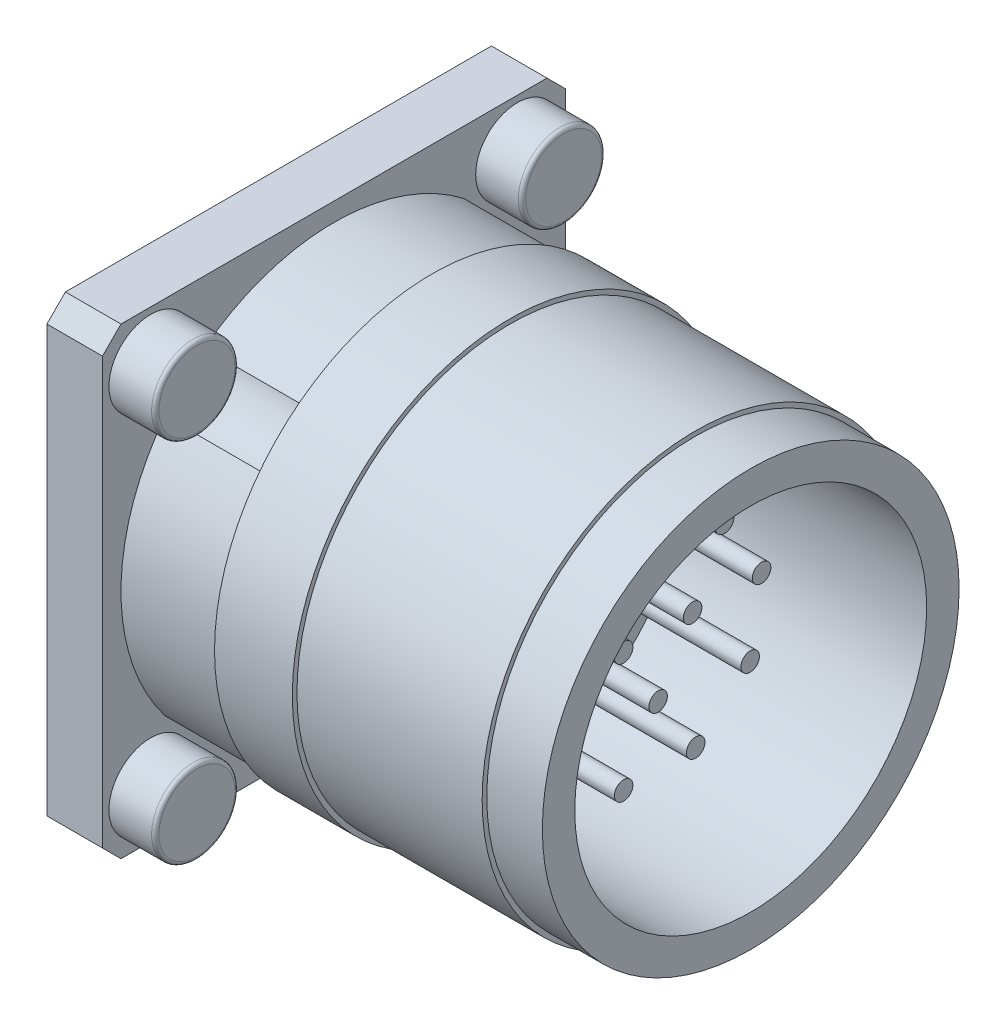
ISO-10303-21;
HEADER;
FILE_DESCRIPTION(('STEP AP214'),'2;1');
FILE_NAME('part.step','',(''),(''),'','','');
FILE_SCHEMA(('AUTOMOTIVE_DESIGN { 1 0 10303 214 1 1 1 1 }'));
ENDSEC;
DATA;
#1=APPLICATION_CONTEXT('core data for automotive mechanical design processes');
#2=APPLICATION_PROTOCOL_DEFINITION('international standard','automotive_design',2000,#1);
#3=PRODUCT_CONTEXT('',#1,'mechanical');
#4=PRODUCT('Part','Part','',(#3));
#5=PRODUCT_RELATED_PRODUCT_CATEGORY('part','',(#4));
#6=PRODUCT_DEFINITION_FORMATION('','',#4);
#7=PRODUCT_DEFINITION_CONTEXT('part definition',#1,'design');
#8=PRODUCT_DEFINITION('design','',#6,#7);
#9=PRODUCT_DEFINITION_SHAPE('','',#8);
#10=(LENGTH_UNIT() NAMED_UNIT(*) SI_UNIT(.MILLI.,.METRE.));
#11=(NAMED_UNIT(*) PLANE_ANGLE_UNIT() SI_UNIT($,.RADIAN.));
#12=(NAMED_UNIT(*) SI_UNIT($,.STERADIAN.) SOLID_ANGLE_UNIT());
#13=UNCERTAINTY_MEASURE_WITH_UNIT(LENGTH_MEASURE(1.E-05),#10,'distance_accuracy_value','');
#14=(GEOMETRIC_REPRESENTATION_CONTEXT(3) GLOBAL_UNCERTAINTY_ASSIGNED_CONTEXT((#13)) GLOBAL_UNIT_ASSIGNED_CONTEXT((#10,
#11,#12)) REPRESENTATION_CONTEXT('',''));
#15=CARTESIAN_POINT('',(0.,0.,0.));
#16=DIRECTION('',(0.,0.,1.));
#17=DIRECTION('',(1.,0.,0.));
#18=AXIS2_PLACEMENT_3D('',#15,#16,#17);
#19=CARTESIAN_POINT('',(3.,0.,24.));
#20=DIRECTION('',(1.,0.,0.));
#21=DIRECTION('',(0.,0.,-1.));
#22=AXIS2_PLACEMENT_3D('',#19,#20,#21);
#23=PLANE('',#22);
#24=CARTESIAN_POINT('',(3.,9.9,-9.9));
#25=DIRECTION('',(-1.,0.,0.));
#26=DIRECTION('',(0.,0.,1.));
#27=AXIS2_PLACEMENT_3D('',#24,#25,#26);
#28=CIRCLE('',#27,2.25);
#29=CARTESIAN_POINT('',(3.,9.9,-7.65));
#30=VERTEX_POINT('',#29);
#31=EDGE_CURVE('E351',#30,#30,#28,.T.);
#32=ORIENTED_EDGE('',*,*,#31,.T.);
#33=EDGE_LOOP('',(#32));
#34=FACE_BOUND('',#33,.T.);
#35=CARTESIAN_POINT('',(3.,9.9,9.9));
#36=DIRECTION('',(-1.,0.,0.));
#37=DIRECTION('',(0.,0.,1.));
#38=AXIS2_PLACEMENT_3D('',#35,#36,#37);
#39=CIRCLE('',#38,2.25);
#40=CARTESIAN_POINT('',(3.,9.9,12.15));
#41=VERTEX_POINT('',#40);
#42=EDGE_CURVE('E173',#41,#41,#39,.T.);
#43=ORIENTED_EDGE('',*,*,#42,.T.);
#44=EDGE_LOOP('',(#43));
#45=FACE_BOUND('',#44,.T.);
#46=DIRECTION('',(0.,0.,-1.));
#47=VECTOR('',#46,1.);
#48=CARTESIAN_POINT('',(3.,-12.5,11.5));
#49=LINE('',#48,#47);
#50=CARTESIAN_POINT('',(3.,-12.5,11.5));
#51=VERTEX_POINT('',#50);
#52=CARTESIAN_POINT('',(3.,-12.5,-11.5));
#53=VERTEX_POINT('',#52);
#54=EDGE_CURVE('E264',#51,#53,#49,.T.);
#55=ORIENTED_EDGE('',*,*,#54,.T.);
#56=DIRECTION('',(0.,0.707106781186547,-0.707106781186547));
#57=VECTOR('',#56,1.);
#58=CARTESIAN_POINT('',(3.,-12.5,-11.5));
#59=LINE('',#58,#57);
#60=CARTESIAN_POINT('',(3.,-11.5,-12.5));
#61=VERTEX_POINT('',#60);
#62=EDGE_CURVE('E266',#53,#61,#59,.T.);
#63=ORIENTED_EDGE('',*,*,#62,.T.);
#64=DIRECTION('',(0.,1.,0.));
#65=VECTOR('',#64,1.);
#66=CARTESIAN_POINT('',(3.,-11.5,-12.5));
#67=LINE('',#66,#65);
#68=CARTESIAN_POINT('',(3.,11.5,-12.5));
#69=VERTEX_POINT('',#68);
#70=EDGE_CURVE('E268',#61,#69,#67,.T.);
#71=ORIENTED_EDGE('',*,*,#70,.T.);
#72=DIRECTION('',(0.,0.707106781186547,0.707106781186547));
#73=VECTOR('',#72,1.);
#74=CARTESIAN_POINT('',(3.,11.5,-12.5));
#75=LINE('',#74,#73);
#76=CARTESIAN_POINT('',(3.,12.5,-11.5));
#77=VERTEX_POINT('',#76);
#78=EDGE_CURVE('E53',#69,#77,#75,.T.);
#79=ORIENTED_EDGE('',*,*,#78,.T.);
#80=DIRECTION('',(0.,0.,1.));
#81=VECTOR('',#80,1.);
#82=CARTESIAN_POINT('',(3.,12.5,-11.5));
#83=LINE('',#82,#81);
#84=CARTESIAN_POINT('',(3.,12.5,11.5));
#85=VERTEX_POINT('',#84);
#86=EDGE_CURVE('E48',#77,#85,#83,.T.);
#87=ORIENTED_EDGE('',*,*,#86,.T.);
#88=DIRECTION('',(0.,-0.707106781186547,0.707106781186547));
#89=VECTOR('',#88,1.);
#90=CARTESIAN_POINT('',(3.,12.5,11.5));
#91=LINE('',#90,#89);
#92=CARTESIAN_POINT('',(3.,11.5,12.5));
#93=VERTEX_POINT('',#92);
#94=EDGE_CURVE('E258',#85,#93,#91,.T.);
#95=ORIENTED_EDGE('',*,*,#94,.T.);
#96=DIRECTION('',(0.,-1.,0.));
#97=VECTOR('',#96,1.);
#98=CARTESIAN_POINT('',(3.,11.5,12.5));
#99=LINE('',#98,#97);
#100=CARTESIAN_POINT('',(3.,-11.5,12.5));
#101=VERTEX_POINT('',#100);
#102=EDGE_CURVE('E260',#93,#101,#99,.T.);
#103=ORIENTED_EDGE('',*,*,#102,.T.);
#104=DIRECTION('',(0.,-0.707106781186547,-0.707106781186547));
#105=VECTOR('',#104,1.);
#106=CARTESIAN_POINT('',(3.,-11.5,12.5));
#107=LINE('',#106,#105);
#108=EDGE_CURVE('E262',#101,#51,#107,.T.);
#109=ORIENTED_EDGE('',*,*,#108,.T.);
#110=EDGE_LOOP('',(#55,#63,#71,#79,#87,#95,#103,#109));
#111=FACE_BOUND('',#110,.T.);
#112=CARTESIAN_POINT('',(3.,9.90000000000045,9.90000000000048));
#113=DIRECTION('',(-1.,0.,0.));
#114=DIRECTION('',(0.,0.,1.));
#115=AXIS2_PLACEMENT_3D('',#112,#113,#114);
#116=CIRCLE('',#115,3.0000000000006);
#117=CARTESIAN_POINT('',(3.,9.12215188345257,7.00259559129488));
#118=VERTEX_POINT('',#117);
#119=CARTESIAN_POINT('',(3.,7.00259559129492,9.12215188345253));
#120=VERTEX_POINT('',#119);
#121=EDGE_CURVE('E151',#118,#120,#116,.T.);
#122=ORIENTED_EDGE('',*,*,#121,.F.);
#123=CARTESIAN_POINT('',(3.,0.,0.));
#124=DIRECTION('',(1.,0.,0.));
#125=DIRECTION('',(0.,0.,-1.));
#126=AXIS2_PLACEMENT_3D('',#123,#124,#125);
#127=CIRCLE('',#126,11.5);
#128=CARTESIAN_POINT('',(3.,9.1221518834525,-7.0025955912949));
#129=VERTEX_POINT('',#128);
#130=EDGE_CURVE('E193',#129,#118,#127,.T.);
#131=ORIENTED_EDGE('',*,*,#130,.F.);
#132=CARTESIAN_POINT('',(3.,9.90000000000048,-9.90000000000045));
#133=DIRECTION('',(-1.,0.,0.));
#134=DIRECTION('',(0.,0.,1.));
#135=AXIS2_PLACEMENT_3D('',#132,#133,#134);
#136=CIRCLE('',#135,3.0000000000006);
#137=CARTESIAN_POINT('',(3.,7.00259559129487,-9.12215188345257));
#138=VERTEX_POINT('',#137);
#139=EDGE_CURVE('E190',#138,#129,#136,.T.);
#140=ORIENTED_EDGE('',*,*,#139,.F.);
#141=CARTESIAN_POINT('',(3.,0.,0.));
#142=DIRECTION('',(1.,0.,0.));
#143=DIRECTION('',(0.,0.,-1.));
#144=AXIS2_PLACEMENT_3D('',#141,#142,#143);
#145=CIRCLE('',#144,11.5);
#146=CARTESIAN_POINT('',(3.,-7.0025955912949,-9.1221518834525));
#147=VERTEX_POINT('',#146);
#148=EDGE_CURVE('E187',#147,#138,#145,.T.);
#149=ORIENTED_EDGE('',*,*,#148,.F.);
#150=CARTESIAN_POINT('',(3.,-9.90000000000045,-9.90000000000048));
#151=DIRECTION('',(-1.,0.,0.));
#152=DIRECTION('',(0.,0.,1.));
#153=AXIS2_PLACEMENT_3D('',#150,#151,#152);
#154=CIRCLE('',#153,3.0000000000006);
#155=CARTESIAN_POINT('',(3.,-9.12215188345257,-7.00259559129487));
#156=VERTEX_POINT('',#155);
#157=EDGE_CURVE('E184',#156,#147,#154,.T.);
#158=ORIENTED_EDGE('',*,*,#157,.F.);
#159=CARTESIAN_POINT('',(3.,0.,0.));
#160=DIRECTION('',(1.,0.,0.));
#161=DIRECTION('',(0.,0.,-1.));
#162=AXIS2_PLACEMENT_3D('',#159,#160,#161);
#163=CIRCLE('',#162,11.5);
#164=CARTESIAN_POINT('',(3.,-9.1221518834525,7.0025955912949));
#165=VERTEX_POINT('',#164);
#166=EDGE_CURVE('E181',#165,#156,#163,.T.);
#167=ORIENTED_EDGE('',*,*,#166,.F.);
#168=CARTESIAN_POINT('',(3.,-9.90000000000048,9.90000000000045));
#169=DIRECTION('',(-1.,0.,0.));
#170=DIRECTION('',(0.,0.,1.));
#171=AXIS2_PLACEMENT_3D('',#168,#169,#170);
#172=CIRCLE('',#171,3.0000000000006);
#173=CARTESIAN_POINT('',(3.,-7.00259559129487,9.12215188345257));
#174=VERTEX_POINT('',#173);
#175=EDGE_CURVE('E155',#174,#165,#172,.T.);
#176=ORIENTED_EDGE('',*,*,#175,.F.);
#177=CARTESIAN_POINT('',(3.,0.,0.));
#178=DIRECTION('',(1.,0.,0.));
#179=DIRECTION('',(0.,0.,-1.));
#180=AXIS2_PLACEMENT_3D('',#177,#178,#179);
#181=CIRCLE('',#180,11.5);
#182=EDGE_CURVE('E146',#120,#174,#181,.T.);
#183=ORIENTED_EDGE('',*,*,#182,.F.);
#184=EDGE_LOOP('',(#122,#131,#140,#149,#158,#167,#176,#183));
#185=FACE_BOUND('',#184,.T.);
#186=CARTESIAN_POINT('',(3.,-9.9,9.9));
#187=DIRECTION('',(-1.,0.,0.));
#188=DIRECTION('',(0.,0.,1.));
#189=AXIS2_PLACEMENT_3D('',#186,#187,#188);
#190=CIRCLE('',#189,2.25);
#191=CARTESIAN_POINT('',(3.,-9.9,12.15));
#192=VERTEX_POINT('',#191);
#193=EDGE_CURVE('E360',#192,#192,#190,.T.);
#194=ORIENTED_EDGE('',*,*,#193,.T.);
#195=EDGE_LOOP('',(#194));
#196=FACE_BOUND('',#195,.T.);
#197=CARTESIAN_POINT('',(3.,-9.9,-9.9));
#198=DIRECTION('',(-1.,0.,0.));
#199=DIRECTION('',(0.,0.,1.));
#200=AXIS2_PLACEMENT_3D('',#197,#198,#199);
#201=CIRCLE('',#200,2.25);
#202=CARTESIAN_POINT('',(3.,-9.9,-7.65));
#203=VERTEX_POINT('',#202);
#204=EDGE_CURVE('E338',#203,#203,#201,.T.);
#205=ORIENTED_EDGE('',*,*,#204,.T.);
#206=EDGE_LOOP('',(#205));
#207=FACE_BOUND('',#206,.T.);
#208=ADVANCED_FACE('F31',(#34,#45,#111,#185,#196,#207),#23,.T.);
#209=CARTESIAN_POINT('',(20.5,0.,0.));
#210=DIRECTION('',(-1.,0.,0.));
#211=DIRECTION('',(0.,0.,1.));
#212=AXIS2_PLACEMENT_3D('',#209,#210,#211);
#213=CYLINDRICAL_SURFACE('',#212,11.75);
#214=CARTESIAN_POINT('',(8.3,0.,0.));
#215=DIRECTION('',(1.,0.,0.));
#216=DIRECTION('',(0.,0.,-1.));
#217=AXIS2_PLACEMENT_3D('',#214,#215,#216);
#218=CIRCLE('',#217,11.75);
#219=CARTESIAN_POINT('',(8.3,0.,-11.75));
#220=VERTEX_POINT('',#219);
#221=EDGE_CURVE('E166',#220,#220,#218,.T.);
#222=ORIENTED_EDGE('',*,*,#221,.T.);
#223=EDGE_LOOP('',(#222));
#224=FACE_BOUND('',#223,.T.);
#225=CARTESIAN_POINT('',(12.5,0.,0.));
#226=DIRECTION('',(-1.,0.,0.));
#227=DIRECTION('',(0.,0.,1.));
#228=AXIS2_PLACEMENT_3D('',#225,#226,#227);
#229=CIRCLE('',#228,11.75);
#230=CARTESIAN_POINT('',(12.5,0.,11.75));
#231=VERTEX_POINT('',#230);
#232=EDGE_CURVE('E238',#231,#231,#229,.T.);
#233=ORIENTED_EDGE('',*,*,#232,.T.);
#234=EDGE_LOOP('',(#233));
#235=FACE_BOUND('',#234,.T.);
#236=ADVANCED_FACE('F387',(#224,#235),#213,.T.);
#237=CARTESIAN_POINT('',(12.5,11.75,0.));
#238=DIRECTION('',(-1.,0.,0.));
#239=DIRECTION('',(0.,0.,1.));
#240=AXIS2_PLACEMENT_3D('',#237,#238,#239);
#241=PLANE('',#240);
#242=ORIENTED_EDGE('',*,*,#232,.F.);
#243=EDGE_LOOP('',(#242));
#244=FACE_BOUND('',#243,.T.);
#245=CARTESIAN_POINT('',(12.5,0.,0.));
#246=DIRECTION('',(-1.,0.,0.));
#247=DIRECTION('',(0.,0.,1.));
#248=AXIS2_PLACEMENT_3D('',#245,#246,#247);
#249=CIRCLE('',#248,11.5);
#250=CARTESIAN_POINT('',(12.5,0.,11.5));
#251=VERTEX_POINT('',#250);
#252=EDGE_CURVE('E235',#251,#251,#249,.T.);
#253=ORIENTED_EDGE('',*,*,#252,.T.);
#254=EDGE_LOOP('',(#253));
#255=FACE_BOUND('',#254,.T.);
#256=ADVANCED_FACE('F393',(#244,#255),#241,.F.);
#257=CARTESIAN_POINT('',(20.5,0.,0.));
#258=DIRECTION('',(-1.,0.,0.));
#259=DIRECTION('',(0.,0.,1.));
#260=AXIS2_PLACEMENT_3D('',#257,#258,#259);
#261=CYLINDRICAL_SURFACE('',#260,11.5);
#262=ORIENTED_EDGE('',*,*,#252,.F.);
#263=EDGE_LOOP('',(#262));
#264=FACE_BOUND('',#263,.T.);
#265=CARTESIAN_POINT('',(22.5,0.,0.));
#266=DIRECTION('',(-1.,0.,0.));
#267=DIRECTION('',(0.,0.,1.));
#268=AXIS2_PLACEMENT_3D('',#265,#266,#267);
#269=CIRCLE('',#268,11.5);
#270=CARTESIAN_POINT('',(22.5,0.,11.5));
#271=VERTEX_POINT('',#270);
#272=EDGE_CURVE('E232',#271,#271,#269,.T.);
#273=ORIENTED_EDGE('',*,*,#272,.T.);
#274=EDGE_LOOP('',(#273));
#275=FACE_BOUND('',#274,.T.);
#276=ADVANCED_FACE('F874',(#264,#275),#261,.T.);
#277=CARTESIAN_POINT('',(22.5,11.5,0.));
#278=DIRECTION('',(-1.,0.,0.));
#279=DIRECTION('',(0.,0.,1.));
#280=AXIS2_PLACEMENT_3D('',#277,#278,#279);
#281=PLANE('',#280);
#282=ORIENTED_EDGE('',*,*,#272,.F.);
#283=EDGE_LOOP('',(#282));
#284=FACE_BOUND('',#283,.T.);
#285=CARTESIAN_POINT('',(22.5,0.,0.));
#286=DIRECTION('',(-1.,0.,0.));
#287=DIRECTION('',(0.,0.,1.));
#288=AXIS2_PLACEMENT_3D('',#285,#286,#287);
#289=CIRCLE('',#288,11.25);
#290=CARTESIAN_POINT('',(22.5,0.,11.25));
#291=VERTEX_POINT('',#290);
#292=EDGE_CURVE('E229',#291,#291,#289,.T.);
#293=ORIENTED_EDGE('',*,*,#292,.T.);
#294=EDGE_LOOP('',(#293));
#295=FACE_BOUND('',#294,.T.);
#296=ADVANCED_FACE('F870',(#284,#295),#281,.F.);
#297=CARTESIAN_POINT('',(20.5,0.,0.));
#298=DIRECTION('',(-1.,0.,0.));
#299=DIRECTION('',(0.,0.,1.));
#300=AXIS2_PLACEMENT_3D('',#297,#298,#299);
#301=CYLINDRICAL_SURFACE('',#300,11.25);
#302=ORIENTED_EDGE('',*,*,#292,.F.);
#303=EDGE_LOOP('',(#302));
#304=FACE_BOUND('',#303,.T.);
#305=CARTESIAN_POINT('',(25.5,0.,0.));
#306=DIRECTION('',(-1.,0.,0.));
#307=DIRECTION('',(0.,0.,1.));
#308=AXIS2_PLACEMENT_3D('',#305,#306,#307);
#309=CIRCLE('',#308,11.25);
#310=CARTESIAN_POINT('',(25.5,0.,11.25));
#311=VERTEX_POINT('',#310);
#312=EDGE_CURVE('E226',#311,#311,#309,.T.);
#313=ORIENTED_EDGE('',*,*,#312,.T.);
#314=EDGE_LOOP('',(#313));
#315=FACE_BOUND('',#314,.T.);
#316=ADVANCED_FACE('F866',(#304,#315),#301,.T.);
#317=CARTESIAN_POINT('',(25.5,11.25,0.));
#318=DIRECTION('',(-1.,0.,0.));
#319=DIRECTION('',(0.,0.,1.));
#320=AXIS2_PLACEMENT_3D('',#317,#318,#319);
#321=PLANE('',#320);
#322=ORIENTED_EDGE('',*,*,#312,.F.);
#323=EDGE_LOOP('',(#322));
#324=FACE_BOUND('',#323,.T.);
#325=CARTESIAN_POINT('',(25.5,0.,0.));
#326=DIRECTION('',(-1.,0.,0.));
#327=DIRECTION('',(0.,0.,1.));
#328=AXIS2_PLACEMENT_3D('',#325,#326,#327);
#329=CIRCLE('',#328,9.5);
#330=CARTESIAN_POINT('',(25.5,0.,9.5));
#331=VERTEX_POINT('',#330);
#332=EDGE_CURVE('E223',#331,#331,#329,.T.);
#333=ORIENTED_EDGE('',*,*,#332,.T.);
#334=EDGE_LOOP('',(#333));
#335=FACE_BOUND('',#334,.T.);
#336=ADVANCED_FACE('F617',(#324,#335),#321,.F.);
#337=CARTESIAN_POINT('',(20.5,0.,0.));
#338=DIRECTION('',(-1.,0.,0.));
#339=DIRECTION('',(0.,0.,1.));
#340=AXIS2_PLACEMENT_3D('',#337,#338,#339);
#341=CYLINDRICAL_SURFACE('',#340,9.5);
#342=ORIENTED_EDGE('',*,*,#332,.F.);
#343=EDGE_LOOP('',(#342));
#344=FACE_BOUND('',#343,.T.);
#345=CARTESIAN_POINT('',(12.5,0.,0.));
#346=DIRECTION('',(1.,0.,0.));
#347=DIRECTION('',(0.,0.,-1.));
#348=AXIS2_PLACEMENT_3D('',#345,#346,#347);
#349=CIRCLE('',#348,9.5);
#350=CARTESIAN_POINT('',(12.5,0.,-9.5));
#351=VERTEX_POINT('',#350);
#352=EDGE_CURVE('E298',#351,#351,#349,.T.);
#353=ORIENTED_EDGE('',*,*,#352,.F.);
#354=EDGE_LOOP('',(#353));
#355=FACE_BOUND('',#354,.T.);
#356=ADVANCED_FACE('F611',(#344,#355),#341,.F.);
#357=CARTESIAN_POINT('',(8.3,0.,0.));
#358=DIRECTION('',(1.,0.,0.));
#359=DIRECTION('',(0.,0.,-1.));
#360=AXIS2_PLACEMENT_3D('',#357,#358,#359);
#361=PLANE('',#360);
#362=CARTESIAN_POINT('',(8.3,0.,0.));
#363=DIRECTION('',(1.,0.,0.));
#364=DIRECTION('',(0.,0.,-1.));
#365=AXIS2_PLACEMENT_3D('',#362,#363,#364);
#366=CIRCLE('',#365,11.5);
#367=CARTESIAN_POINT('',(8.3,7.00259559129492,9.12215188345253));
#368=VERTEX_POINT('',#367);
#369=CARTESIAN_POINT('',(8.3,-7.00259559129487,9.12215188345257));
#370=VERTEX_POINT('',#369);
#371=EDGE_CURVE('E163',#368,#370,#366,.T.);
#372=ORIENTED_EDGE('',*,*,#371,.T.);
#373=CARTESIAN_POINT('',(8.3,-9.90000000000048,9.90000000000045));
#374=DIRECTION('',(-1.,0.,0.));
#375=DIRECTION('',(0.,0.,1.));
#376=AXIS2_PLACEMENT_3D('',#373,#374,#375);
#377=CIRCLE('',#376,3.0000000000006);
#378=CARTESIAN_POINT('',(8.3,-9.1221518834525,7.0025955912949));
#379=VERTEX_POINT('',#378);
#380=EDGE_CURVE('E198',#370,#379,#377,.T.);
#381=ORIENTED_EDGE('',*,*,#380,.T.);
#382=CARTESIAN_POINT('',(8.3,0.,0.));
#383=DIRECTION('',(1.,0.,0.));
#384=DIRECTION('',(0.,0.,-1.));
#385=AXIS2_PLACEMENT_3D('',#382,#383,#384);
#386=CIRCLE('',#385,11.5);
#387=CARTESIAN_POINT('',(8.3,-9.12215188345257,-7.00259559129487));
#388=VERTEX_POINT('',#387);
#389=EDGE_CURVE('E200',#379,#388,#386,.T.);
#390=ORIENTED_EDGE('',*,*,#389,.T.);
#391=CARTESIAN_POINT('',(8.3,-9.90000000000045,-9.90000000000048));
#392=DIRECTION('',(-1.,0.,0.));
#393=DIRECTION('',(0.,0.,1.));
#394=AXIS2_PLACEMENT_3D('',#391,#392,#393);
#395=CIRCLE('',#394,3.0000000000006);
#396=CARTESIAN_POINT('',(8.3,-7.0025955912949,-9.1221518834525));
#397=VERTEX_POINT('',#396);
#398=EDGE_CURVE('E202',#388,#397,#395,.T.);
#399=ORIENTED_EDGE('',*,*,#398,.T.);
#400=CARTESIAN_POINT('',(8.3,0.,0.));
#401=DIRECTION('',(1.,0.,0.));
#402=DIRECTION('',(0.,0.,-1.));
#403=AXIS2_PLACEMENT_3D('',#400,#401,#402);
#404=CIRCLE('',#403,11.5);
#405=CARTESIAN_POINT('',(8.3,7.00259559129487,-9.12215188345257));
#406=VERTEX_POINT('',#405);
#407=EDGE_CURVE('E204',#397,#406,#404,.T.);
#408=ORIENTED_EDGE('',*,*,#407,.T.);
#409=CARTESIAN_POINT('',(8.3,9.90000000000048,-9.90000000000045));
#410=DIRECTION('',(-1.,0.,0.));
#411=DIRECTION('',(0.,0.,1.));
#412=AXIS2_PLACEMENT_3D('',#409,#410,#411);
#413=CIRCLE('',#412,3.0000000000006);
#414=CARTESIAN_POINT('',(8.3,9.12215188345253,-7.00259559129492));
#415=VERTEX_POINT('',#414);
#416=EDGE_CURVE('E206',#406,#415,#413,.T.);
#417=ORIENTED_EDGE('',*,*,#416,.T.);
#418=CARTESIAN_POINT('',(8.3,0.,0.));
#419=DIRECTION('',(1.,0.,0.));
#420=DIRECTION('',(0.,0.,-1.));
#421=AXIS2_PLACEMENT_3D('',#418,#419,#420);
#422=CIRCLE('',#421,11.5);
#423=CARTESIAN_POINT('',(8.3,9.12215188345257,7.00259559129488));
#424=VERTEX_POINT('',#423);
#425=EDGE_CURVE('E209',#415,#424,#422,.T.);
#426=ORIENTED_EDGE('',*,*,#425,.T.);
#427=CARTESIAN_POINT('',(8.3,9.90000000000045,9.90000000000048));
#428=DIRECTION('',(-1.,0.,0.));
#429=DIRECTION('',(0.,0.,1.));
#430=AXIS2_PLACEMENT_3D('',#427,#428,#429);
#431=CIRCLE('',#430,3.0000000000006);
#432=EDGE_CURVE('E195',#424,#368,#431,.T.);
#433=ORIENTED_EDGE('',*,*,#432,.T.);
#434=EDGE_LOOP('',(#372,#381,#390,#399,#408,#417,#426,#433));
#435=FACE_BOUND('',#434,.T.);
#436=ORIENTED_EDGE('',*,*,#221,.F.);
#437=EDGE_LOOP('',(#436));
#438=FACE_BOUND('',#437,.T.);
#439=ADVANCED_FACE('F616',(#435,#438),#361,.F.);
#440=CARTESIAN_POINT('',(8.3,9.90000000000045,9.90000000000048));
#441=DIRECTION('',(-1.,0.,0.));
#442=DIRECTION('',(0.,0.,1.));
#443=AXIS2_PLACEMENT_3D('',#440,#441,#442);
#444=CYLINDRICAL_SURFACE('',#443,3.0000000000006);
#445=ORIENTED_EDGE('',*,*,#121,.T.);
#446=DIRECTION('',(-1.,0.,0.));
#447=VECTOR('',#446,1.);
#448=CARTESIAN_POINT('',(8.3,7.00259559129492,9.12215188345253));
#449=LINE('',#448,#447);
#450=EDGE_CURVE('E161',#368,#120,#449,.T.);
#451=ORIENTED_EDGE('',*,*,#450,.F.);
#452=ORIENTED_EDGE('',*,*,#432,.F.);
#453=DIRECTION('',(-1.,0.,0.));
#454=VECTOR('',#453,1.);
#455=CARTESIAN_POINT('',(8.3,9.12215188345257,7.00259559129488));
#456=LINE('',#455,#454);
#457=EDGE_CURVE('E171',#424,#118,#456,.T.);
#458=ORIENTED_EDGE('',*,*,#457,.T.);
#459=EDGE_LOOP('',(#445,#451,#452,#458));
#460=FACE_BOUND('',#459,.T.);
#461=ADVANCED_FACE('F169',(#460),#444,.F.);
#462=CARTESIAN_POINT('',(8.3,0.,0.));
#463=DIRECTION('',(-1.,0.,0.));
#464=DIRECTION('',(0.,0.,1.));
#465=AXIS2_PLACEMENT_3D('',#462,#463,#464);
#466=CYLINDRICAL_SURFACE('',#465,11.5);
#467=ORIENTED_EDGE('',*,*,#182,.T.);
#468=DIRECTION('',(-1.,0.,0.));
#469=VECTOR('',#468,1.);
#470=CARTESIAN_POINT('',(8.3,-7.00259559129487,9.12215188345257));
#471=LINE('',#470,#469);
#472=EDGE_CURVE('E167',#370,#174,#471,.T.);
#473=ORIENTED_EDGE('',*,*,#472,.F.);
#474=ORIENTED_EDGE('',*,*,#371,.F.);
#475=ORIENTED_EDGE('',*,*,#450,.T.);
#476=EDGE_LOOP('',(#467,#473,#474,#475));
#477=FACE_BOUND('',#476,.T.);
#478=ADVANCED_FACE('F162',(#477),#466,.T.);
#479=CARTESIAN_POINT('',(8.3,-9.90000000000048,9.90000000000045));
#480=DIRECTION('',(-1.,0.,0.));
#481=DIRECTION('',(0.,0.,1.));
#482=AXIS2_PLACEMENT_3D('',#479,#480,#481);
#483=CYLINDRICAL_SURFACE('',#482,3.0000000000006);
#484=ORIENTED_EDGE('',*,*,#175,.T.);
#485=DIRECTION('',(-1.,0.,0.));
#486=VECTOR('',#485,1.);
#487=CARTESIAN_POINT('',(8.3,-9.1221518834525,7.0025955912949));
#488=LINE('',#487,#486);
#489=EDGE_CURVE('E220',#379,#165,#488,.T.);
#490=ORIENTED_EDGE('',*,*,#489,.F.);
#491=ORIENTED_EDGE('',*,*,#380,.F.);
#492=ORIENTED_EDGE('',*,*,#472,.T.);
#493=EDGE_LOOP('',(#484,#490,#491,#492));
#494=FACE_BOUND('',#493,.T.);
#495=ADVANCED_FACE('F1020',(#494),#483,.F.);
#496=CARTESIAN_POINT('',(8.3,0.,0.));
#497=DIRECTION('',(-1.,0.,0.));
#498=DIRECTION('',(0.,0.,1.));
#499=AXIS2_PLACEMENT_3D('',#496,#497,#498);
#500=CYLINDRICAL_SURFACE('',#499,11.5);
#501=ORIENTED_EDGE('',*,*,#166,.T.);
#502=DIRECTION('',(-1.,0.,0.));
#503=VECTOR('',#502,1.);
#504=CARTESIAN_POINT('',(8.3,-9.12215188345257,-7.00259559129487));
#505=LINE('',#504,#503);
#506=EDGE_CURVE('E218',#388,#156,#505,.T.);
#507=ORIENTED_EDGE('',*,*,#506,.F.);
#508=ORIENTED_EDGE('',*,*,#389,.F.);
#509=ORIENTED_EDGE('',*,*,#489,.T.);
#510=EDGE_LOOP('',(#501,#507,#508,#509));
#511=FACE_BOUND('',#510,.T.);
#512=ADVANCED_FACE('F1029',(#511),#500,.T.);
#513=CARTESIAN_POINT('',(8.3,-9.90000000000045,-9.90000000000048));
#514=DIRECTION('',(-1.,0.,0.));
#515=DIRECTION('',(0.,0.,1.));
#516=AXIS2_PLACEMENT_3D('',#513,#514,#515);
#517=CYLINDRICAL_SURFACE('',#516,3.0000000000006);
#518=ORIENTED_EDGE('',*,*,#157,.T.);
#519=DIRECTION('',(-1.,0.,0.));
#520=VECTOR('',#519,1.);
#521=CARTESIAN_POINT('',(8.3,-7.0025955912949,-9.1221518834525));
#522=LINE('',#521,#520);
#523=EDGE_CURVE('E216',#397,#147,#522,.T.);
#524=ORIENTED_EDGE('',*,*,#523,.F.);
#525=ORIENTED_EDGE('',*,*,#398,.F.);
#526=ORIENTED_EDGE('',*,*,#506,.T.);
#527=EDGE_LOOP('',(#518,#524,#525,#526));
#528=FACE_BOUND('',#527,.T.);
#529=ADVANCED_FACE('F1039',(#528),#517,.F.);
#530=CARTESIAN_POINT('',(8.3,0.,0.));
#531=DIRECTION('',(-1.,0.,0.));
#532=DIRECTION('',(0.,0.,1.));
#533=AXIS2_PLACEMENT_3D('',#530,#531,#532);
#534=CYLINDRICAL_SURFACE('',#533,11.5);
#535=ORIENTED_EDGE('',*,*,#148,.T.);
#536=DIRECTION('',(-1.,0.,0.));
#537=VECTOR('',#536,1.);
#538=CARTESIAN_POINT('',(8.3,7.00259559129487,-9.12215188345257));
#539=LINE('',#538,#537);
#540=EDGE_CURVE('E214',#406,#138,#539,.T.);
#541=ORIENTED_EDGE('',*,*,#540,.F.);
#542=ORIENTED_EDGE('',*,*,#407,.F.);
#543=ORIENTED_EDGE('',*,*,#523,.T.);
#544=EDGE_LOOP('',(#535,#541,#542,#543));
#545=FACE_BOUND('',#544,.T.);
#546=ADVANCED_FACE('F1049',(#545),#534,.T.);
#547=CARTESIAN_POINT('',(8.3,9.90000000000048,-9.90000000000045));
#548=DIRECTION('',(-1.,0.,0.));
#549=DIRECTION('',(0.,0.,1.));
#550=AXIS2_PLACEMENT_3D('',#547,#548,#549);
#551=CYLINDRICAL_SURFACE('',#550,3.0000000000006);
#552=ORIENTED_EDGE('',*,*,#139,.T.);
#553=DIRECTION('',(-1.,0.,0.));
#554=VECTOR('',#553,1.);
#555=CARTESIAN_POINT('',(8.3,9.1221518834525,-7.0025955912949));
#556=LINE('',#555,#554);
#557=EDGE_CURVE('E212',#415,#129,#556,.T.);
#558=ORIENTED_EDGE('',*,*,#557,.F.);
#559=ORIENTED_EDGE('',*,*,#416,.F.);
#560=ORIENTED_EDGE('',*,*,#540,.T.);
#561=EDGE_LOOP('',(#552,#558,#559,#560));
#562=FACE_BOUND('',#561,.T.);
#563=ADVANCED_FACE('F1058',(#562),#551,.F.);
#564=CARTESIAN_POINT('',(8.3,0.,0.));
#565=DIRECTION('',(-1.,0.,0.));
#566=DIRECTION('',(0.,0.,1.));
#567=AXIS2_PLACEMENT_3D('',#564,#565,#566);
#568=CYLINDRICAL_SURFACE('',#567,11.5);
#569=ORIENTED_EDGE('',*,*,#130,.T.);
#570=ORIENTED_EDGE('',*,*,#457,.F.);
#571=ORIENTED_EDGE('',*,*,#425,.F.);
#572=ORIENTED_EDGE('',*,*,#557,.T.);
#573=EDGE_LOOP('',(#569,#570,#571,#572));
#574=FACE_BOUND('',#573,.T.);
#575=ADVANCED_FACE('F423',(#574),#568,.T.);
#576=CARTESIAN_POINT('',(3.,-11.5,12.5));
#577=DIRECTION('',(0.,0.707106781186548,-0.707106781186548));
#578=DIRECTION('',(0.,0.707106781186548,0.707106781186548));
#579=AXIS2_PLACEMENT_3D('',#576,#577,#578);
#580=PLANE('',#579);
#581=DIRECTION('',(0.,-0.707106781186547,-0.707106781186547));
#582=VECTOR('',#581,1.);
#583=CARTESIAN_POINT('',(0.,-11.5,12.5));
#584=LINE('',#583,#582);
#585=CARTESIAN_POINT('',(0.,-11.5,12.5));
#586=VERTEX_POINT('',#585);
#587=CARTESIAN_POINT('',(0.,-12.5,11.5));
#588=VERTEX_POINT('',#587);
#589=EDGE_CURVE('E246',#586,#588,#584,.T.);
#590=ORIENTED_EDGE('',*,*,#589,.T.);
#591=DIRECTION('',(-1.,0.,0.));
#592=VECTOR('',#591,1.);
#593=CARTESIAN_POINT('',(3.,-12.5,11.5));
#594=LINE('',#593,#592);
#595=EDGE_CURVE('E287',#51,#588,#594,.T.);
#596=ORIENTED_EDGE('',*,*,#595,.F.);
#597=ORIENTED_EDGE('',*,*,#108,.F.);
#598=DIRECTION('',(-1.,0.,0.));
#599=VECTOR('',#598,1.);
#600=CARTESIAN_POINT('',(3.,-11.5,12.5));
#601=LINE('',#600,#599);
#602=EDGE_CURVE('E40',#101,#586,#601,.T.);
#603=ORIENTED_EDGE('',*,*,#602,.T.);
#604=EDGE_LOOP('',(#590,#596,#597,#603));
#605=FACE_BOUND('',#604,.T.);
#606=ADVANCED_FACE('F421',(#605),#580,.F.);
#607=CARTESIAN_POINT('',(3.,12.5,11.5));
#608=DIRECTION('',(0.,-0.707106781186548,-0.707106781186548));
#609=DIRECTION('',(0.,0.707106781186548,-0.707106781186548));
#610=AXIS2_PLACEMENT_3D('',#607,#608,#609);
#611=PLANE('',#610);
#612=DIRECTION('',(0.,-0.707106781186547,0.707106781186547));
#613=VECTOR('',#612,1.);
#614=CARTESIAN_POINT('',(0.,12.5,11.5));
#615=LINE('',#614,#613);
#616=CARTESIAN_POINT('',(0.,12.5,11.5));
#617=VERTEX_POINT('',#616);
#618=CARTESIAN_POINT('',(0.,11.5,12.5));
#619=VERTEX_POINT('',#618);
#620=EDGE_CURVE('E241',#617,#619,#615,.T.);
#621=ORIENTED_EDGE('',*,*,#620,.T.);
#622=DIRECTION('',(-1.,0.,0.));
#623=VECTOR('',#622,1.);
#624=CARTESIAN_POINT('',(3.,11.5,12.5));
#625=LINE('',#624,#623);
#626=EDGE_CURVE('E11',#93,#619,#625,.T.);
#627=ORIENTED_EDGE('',*,*,#626,.F.);
#628=ORIENTED_EDGE('',*,*,#94,.F.);
#629=DIRECTION('',(-1.,0.,0.));
#630=VECTOR('',#629,1.);
#631=CARTESIAN_POINT('',(3.,12.5,11.5));
#632=LINE('',#631,#630);
#633=EDGE_CURVE('E272',#85,#617,#632,.T.);
#634=ORIENTED_EDGE('',*,*,#633,.T.);
#635=EDGE_LOOP('',(#621,#627,#628,#634));
#636=FACE_BOUND('',#635,.T.);
#637=ADVANCED_FACE('F33',(#636),#611,.F.);
#638=CARTESIAN_POINT('',(3.,11.5,-12.5));
#639=DIRECTION('',(0.,-0.707106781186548,0.707106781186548));
#640=DIRECTION('',(0.,-0.707106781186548,-0.707106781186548));
#641=AXIS2_PLACEMENT_3D('',#638,#639,#640);
#642=PLANE('',#641);
#643=DIRECTION('',(0.,0.707106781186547,0.707106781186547));
#644=VECTOR('',#643,1.);
#645=CARTESIAN_POINT('',(0.,11.5,-12.5));
#646=LINE('',#645,#644);
#647=CARTESIAN_POINT('',(0.,11.5,-12.5));
#648=VERTEX_POINT('',#647);
#649=CARTESIAN_POINT('',(0.,12.5,-11.5));
#650=VERTEX_POINT('',#649);
#651=EDGE_CURVE('E254',#648,#650,#646,.T.);
#652=ORIENTED_EDGE('',*,*,#651,.T.);
#653=DIRECTION('',(-1.,0.,0.));
#654=VECTOR('',#653,1.);
#655=CARTESIAN_POINT('',(3.,12.5,-11.5));
#656=LINE('',#655,#654);
#657=EDGE_CURVE('E275',#77,#650,#656,.T.);
#658=ORIENTED_EDGE('',*,*,#657,.F.);
#659=ORIENTED_EDGE('',*,*,#78,.F.);
#660=DIRECTION('',(-1.,0.,0.));
#661=VECTOR('',#660,1.);
#662=CARTESIAN_POINT('',(3.,11.5,-12.5));
#663=LINE('',#662,#661);
#664=EDGE_CURVE('E278',#69,#648,#663,.T.);
#665=ORIENTED_EDGE('',*,*,#664,.T.);
#666=EDGE_LOOP('',(#652,#658,#659,#665));
#667=FACE_BOUND('',#666,.T.);
#668=ADVANCED_FACE('F406',(#667),#642,.F.);
#669=CARTESIAN_POINT('',(0.,0.,24.));
#670=DIRECTION('',(1.,0.,0.));
#671=DIRECTION('',(0.,0.,-1.));
#672=AXIS2_PLACEMENT_3D('',#669,#670,#671);
#673=PLANE('',#672);
#674=ORIENTED_EDGE('',*,*,#620,.F.);
#675=DIRECTION('',(0.,0.,1.));
#676=VECTOR('',#675,1.);
#677=CARTESIAN_POINT('',(0.,12.5,-11.5));
#678=LINE('',#677,#676);
#679=EDGE_CURVE('E256',#650,#617,#678,.T.);
#680=ORIENTED_EDGE('',*,*,#679,.F.);
#681=ORIENTED_EDGE('',*,*,#651,.F.);
#682=DIRECTION('',(0.,1.,0.));
#683=VECTOR('',#682,1.);
#684=CARTESIAN_POINT('',(0.,-11.5,-12.5));
#685=LINE('',#684,#683);
#686=CARTESIAN_POINT('',(0.,-11.5,-12.5));
#687=VERTEX_POINT('',#686);
#688=EDGE_CURVE('E252',#687,#648,#685,.T.);
#689=ORIENTED_EDGE('',*,*,#688,.F.);
#690=DIRECTION('',(0.,0.707106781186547,-0.707106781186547));
#691=VECTOR('',#690,1.);
#692=CARTESIAN_POINT('',(0.,-12.5,-11.5));
#693=LINE('',#692,#691);
#694=CARTESIAN_POINT('',(0.,-12.5,-11.5));
#695=VERTEX_POINT('',#694);
#696=EDGE_CURVE('E250',#695,#687,#693,.T.);
#697=ORIENTED_EDGE('',*,*,#696,.F.);
#698=DIRECTION('',(0.,0.,-1.));
#699=VECTOR('',#698,1.);
#700=CARTESIAN_POINT('',(0.,-12.5,11.5));
#701=LINE('',#700,#699);
#702=EDGE_CURVE('E248',#588,#695,#701,.T.);
#703=ORIENTED_EDGE('',*,*,#702,.F.);
#704=ORIENTED_EDGE('',*,*,#589,.F.);
#705=DIRECTION('',(0.,-1.,0.));
#706=VECTOR('',#705,1.);
#707=CARTESIAN_POINT('',(0.,11.5,12.5));
#708=LINE('',#707,#706);
#709=EDGE_CURVE('E244',#619,#586,#708,.T.);
#710=ORIENTED_EDGE('',*,*,#709,.F.);
#711=EDGE_LOOP('',(#674,#680,#681,#689,#697,#703,#704,#710));
#712=FACE_BOUND('',#711,.T.);
#713=ADVANCED_FACE('F399',(#712),#673,.F.);
#714=CARTESIAN_POINT('',(3.,-12.5,-11.5));
#715=DIRECTION('',(0.,0.707106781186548,0.707106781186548));
#716=DIRECTION('',(0.,-0.707106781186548,0.707106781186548));
#717=AXIS2_PLACEMENT_3D('',#714,#715,#716);
#718=PLANE('',#717);
#719=ORIENTED_EDGE('',*,*,#696,.T.);
#720=DIRECTION('',(-1.,0.,0.));
#721=VECTOR('',#720,1.);
#722=CARTESIAN_POINT('',(3.,-11.5,-12.5));
#723=LINE('',#722,#721);
#724=EDGE_CURVE('E281',#61,#687,#723,.T.);
#725=ORIENTED_EDGE('',*,*,#724,.F.);
#726=ORIENTED_EDGE('',*,*,#62,.F.);
#727=DIRECTION('',(-1.,0.,0.));
#728=VECTOR('',#727,1.);
#729=CARTESIAN_POINT('',(3.,-12.5,-11.5));
#730=LINE('',#729,#728);
#731=EDGE_CURVE('E284',#53,#695,#730,.T.);
#732=ORIENTED_EDGE('',*,*,#731,.T.);
#733=EDGE_LOOP('',(#719,#725,#726,#732));
#734=FACE_BOUND('',#733,.T.);
#735=ADVANCED_FACE('F413',(#734),#718,.F.);
#736=CARTESIAN_POINT('',(3.,-12.5,11.5));
#737=DIRECTION('',(0.,1.,0.));
#738=DIRECTION('',(0.,0.,1.));
#739=AXIS2_PLACEMENT_3D('',#736,#737,#738);
#740=PLANE('',#739);
#741=ORIENTED_EDGE('',*,*,#702,.T.);
#742=ORIENTED_EDGE('',*,*,#731,.F.);
#743=ORIENTED_EDGE('',*,*,#54,.F.);
#744=ORIENTED_EDGE('',*,*,#595,.T.);
#745=EDGE_LOOP('',(#741,#742,#743,#744));
#746=FACE_BOUND('',#745,.T.);
#747=ADVANCED_FACE('F416',(#746),#740,.F.);
#748=CARTESIAN_POINT('',(3.,11.5,12.5));
#749=DIRECTION('',(0.,0.,-1.));
#750=DIRECTION('',(-1.,0.,0.));
#751=AXIS2_PLACEMENT_3D('',#748,#749,#750);
#752=PLANE('',#751);
#753=ORIENTED_EDGE('',*,*,#709,.T.);
#754=ORIENTED_EDGE('',*,*,#602,.F.);
#755=ORIENTED_EDGE('',*,*,#102,.F.);
#756=ORIENTED_EDGE('',*,*,#626,.T.);
#757=EDGE_LOOP('',(#753,#754,#755,#756));
#758=FACE_BOUND('',#757,.T.);
#759=ADVANCED_FACE('F404',(#758),#752,.F.);
#760=CARTESIAN_POINT('',(3.,12.5,-11.5));
#761=DIRECTION('',(0.,-1.,0.));
#762=DIRECTION('',(0.,0.,-1.));
#763=AXIS2_PLACEMENT_3D('',#760,#761,#762);
#764=PLANE('',#763);
#765=ORIENTED_EDGE('',*,*,#679,.T.);
#766=ORIENTED_EDGE('',*,*,#633,.F.);
#767=ORIENTED_EDGE('',*,*,#86,.F.);
#768=ORIENTED_EDGE('',*,*,#657,.T.);
#769=EDGE_LOOP('',(#765,#766,#767,#768));
#770=FACE_BOUND('',#769,.T.);
#771=ADVANCED_FACE('F400',(#770),#764,.F.);
#772=CARTESIAN_POINT('',(3.,-11.5,-12.5));
#773=DIRECTION('',(0.,0.,1.));
#774=DIRECTION('',(1.,0.,0.));
#775=AXIS2_PLACEMENT_3D('',#772,#773,#774);
#776=PLANE('',#775);
#777=ORIENTED_EDGE('',*,*,#688,.T.);
#778=ORIENTED_EDGE('',*,*,#664,.F.);
#779=ORIENTED_EDGE('',*,*,#70,.F.);
#780=ORIENTED_EDGE('',*,*,#724,.T.);
#781=EDGE_LOOP('',(#777,#778,#779,#780));
#782=FACE_BOUND('',#781,.T.);
#783=ADVANCED_FACE('F403',(#782),#776,.F.);
#784=CARTESIAN_POINT('',(5.5,9.9,9.9));
#785=DIRECTION('',(-1.,0.,0.));
#786=DIRECTION('',(0.,0.,1.));
#787=AXIS2_PLACEMENT_3D('',#784,#785,#786);
#788=CYLINDRICAL_SURFACE('',#787,2.25);
#789=ORIENTED_EDGE('',*,*,#42,.F.);
#790=EDGE_LOOP('',(#789));
#791=FACE_BOUND('',#790,.T.);
#792=CARTESIAN_POINT('',(5.3,9.9,9.9));
#793=DIRECTION('',(-1.,0.,0.));
#794=DIRECTION('',(0.,0.,1.));
#795=AXIS2_PLACEMENT_3D('',#792,#793,#794);
#796=CIRCLE('',#795,2.25);
#797=CARTESIAN_POINT('',(5.3,9.9,12.15));
#798=VERTEX_POINT('',#797);
#799=EDGE_CURVE('E176',#798,#798,#796,.T.);
#800=ORIENTED_EDGE('',*,*,#799,.T.);
#801=EDGE_LOOP('',(#800));
#802=FACE_BOUND('',#801,.T.);
#803=ADVANCED_FACE('F368',(#791,#802),#788,.T.);
#804=CARTESIAN_POINT('',(5.29999999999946,9.9,9.9));
#805=DIRECTION('',(-1.,0.,0.));
#806=DIRECTION('',(0.,0.,1.));
#807=AXIS2_PLACEMENT_3D('',#804,#805,#806);
#808=TOROIDAL_SURFACE('',#807,2.04999999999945,0.200000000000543);
#809=ORIENTED_EDGE('',*,*,#799,.F.);
#810=EDGE_LOOP('',(#809));
#811=FACE_BOUND('',#810,.T.);
#812=CARTESIAN_POINT('',(5.5,9.9,9.9));
#813=DIRECTION('',(-1.,0.,0.));
#814=DIRECTION('',(0.,0.,1.));
#815=AXIS2_PLACEMENT_3D('',#812,#813,#814);
#816=CIRCLE('',#815,2.05);
#817=CARTESIAN_POINT('',(5.5,9.9,11.95));
#818=VERTEX_POINT('',#817);
#819=EDGE_CURVE('E363',#818,#818,#816,.T.);
#820=ORIENTED_EDGE('',*,*,#819,.T.);
#821=EDGE_LOOP('',(#820));
#822=FACE_BOUND('',#821,.T.);
#823=ADVANCED_FACE('F370',(#811,#822),#808,.T.);
#824=CARTESIAN_POINT('',(5.5,11.95,9.9));
#825=DIRECTION('',(-1.,0.,0.));
#826=DIRECTION('',(0.,0.,1.));
#827=AXIS2_PLACEMENT_3D('',#824,#825,#826);
#828=PLANE('',#827);
#829=ORIENTED_EDGE('',*,*,#819,.F.);
#830=EDGE_LOOP('',(#829));
#831=FACE_BOUND('',#830,.T.);
#832=ADVANCED_FACE('F373',(#831),#828,.F.);
#833=CARTESIAN_POINT('',(5.5,-9.9,9.9));
#834=DIRECTION('',(-1.,0.,0.));
#835=DIRECTION('',(0.,0.,1.));
#836=AXIS2_PLACEMENT_3D('',#833,#834,#835);
#837=CYLINDRICAL_SURFACE('',#836,2.25);
#838=ORIENTED_EDGE('',*,*,#193,.F.);
#839=EDGE_LOOP('',(#838));
#840=FACE_BOUND('',#839,.T.);
#841=CARTESIAN_POINT('',(5.3,-9.9,9.9));
#842=DIRECTION('',(-1.,0.,0.));
#843=DIRECTION('',(0.,0.,1.));
#844=AXIS2_PLACEMENT_3D('',#841,#842,#843);
#845=CIRCLE('',#844,2.25);
#846=CARTESIAN_POINT('',(5.3,-9.9,12.15));
#847=VERTEX_POINT('',#846);
#848=EDGE_CURVE('E357',#847,#847,#845,.T.);
#849=ORIENTED_EDGE('',*,*,#848,.T.);
#850=EDGE_LOOP('',(#849));
#851=FACE_BOUND('',#850,.T.);
#852=ADVANCED_FACE('F378',(#840,#851),#837,.T.);
#853=CARTESIAN_POINT('',(5.29999999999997,-9.9,9.9));
#854=DIRECTION('',(-1.,0.,0.));
#855=DIRECTION('',(0.,0.,1.));
#856=AXIS2_PLACEMENT_3D('',#853,#854,#855);
#857=TOROIDAL_SURFACE('',#856,2.04999999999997,0.200000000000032);
#858=ORIENTED_EDGE('',*,*,#848,.F.);
#859=EDGE_LOOP('',(#858));
#860=FACE_BOUND('',#859,.T.);
#861=CARTESIAN_POINT('',(5.5,-9.9,9.9));
#862=DIRECTION('',(-1.,0.,0.));
#863=DIRECTION('',(0.,0.,1.));
#864=AXIS2_PLACEMENT_3D('',#861,#862,#863);
#865=CIRCLE('',#864,2.05);
#866=CARTESIAN_POINT('',(5.5,-9.9,11.95));
#867=VERTEX_POINT('',#866);
#868=EDGE_CURVE('E354',#867,#867,#865,.T.);
#869=ORIENTED_EDGE('',*,*,#868,.T.);
#870=EDGE_LOOP('',(#869));
#871=FACE_BOUND('',#870,.T.);
#872=ADVANCED_FACE('F383',(#860,#871),#857,.T.);
#873=CARTESIAN_POINT('',(5.5,-7.85,9.9));
#874=DIRECTION('',(-1.,0.,0.));
#875=DIRECTION('',(0.,0.,1.));
#876=AXIS2_PLACEMENT_3D('',#873,#874,#875);
#877=PLANE('',#876);
#878=ORIENTED_EDGE('',*,*,#868,.F.);
#879=EDGE_LOOP('',(#878));
#880=FACE_BOUND('',#879,.T.);
#881=ADVANCED_FACE('F528',(#880),#877,.F.);
#882=CARTESIAN_POINT('',(5.5,9.9,-9.9));
#883=DIRECTION('',(-1.,0.,0.));
#884=DIRECTION('',(0.,0.,1.));
#885=AXIS2_PLACEMENT_3D('',#882,#883,#884);
#886=CYLINDRICAL_SURFACE('',#885,2.25);
#887=ORIENTED_EDGE('',*,*,#31,.F.);
#888=EDGE_LOOP('',(#887));
#889=FACE_BOUND('',#888,.T.);
#890=CARTESIAN_POINT('',(5.3,9.9,-9.9));
#891=DIRECTION('',(-1.,0.,0.));
#892=DIRECTION('',(0.,0.,1.));
#893=AXIS2_PLACEMENT_3D('',#890,#891,#892);
#894=CIRCLE('',#893,2.25);
#895=CARTESIAN_POINT('',(5.3,9.9,-7.65));
#896=VERTEX_POINT('',#895);
#897=EDGE_CURVE('E348',#896,#896,#894,.T.);
#898=ORIENTED_EDGE('',*,*,#897,.T.);
#899=EDGE_LOOP('',(#898));
#900=FACE_BOUND('',#899,.T.);
#901=ADVANCED_FACE('F538',(#889,#900),#886,.T.);
#902=CARTESIAN_POINT('',(5.29999999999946,9.9,-9.9));
#903=DIRECTION('',(-1.,0.,0.));
#904=DIRECTION('',(0.,0.,1.));
#905=AXIS2_PLACEMENT_3D('',#902,#903,#904);
#906=TOROIDAL_SURFACE('',#905,2.04999999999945,0.200000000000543);
#907=ORIENTED_EDGE('',*,*,#897,.F.);
#908=EDGE_LOOP('',(#907));
#909=FACE_BOUND('',#908,.T.);
#910=CARTESIAN_POINT('',(5.5,9.9,-9.9));
#911=DIRECTION('',(-1.,0.,0.));
#912=DIRECTION('',(0.,0.,1.));
#913=AXIS2_PLACEMENT_3D('',#910,#911,#912);
#914=CIRCLE('',#913,2.05);
#915=CARTESIAN_POINT('',(5.5,9.9,-7.85));
#916=VERTEX_POINT('',#915);
#917=EDGE_CURVE('E345',#916,#916,#914,.T.);
#918=ORIENTED_EDGE('',*,*,#917,.T.);
#919=EDGE_LOOP('',(#918));
#920=FACE_BOUND('',#919,.T.);
#921=ADVANCED_FACE('F548',(#909,#920),#906,.T.);
#922=CARTESIAN_POINT('',(5.5,11.95,-9.9));
#923=DIRECTION('',(-1.,0.,0.));
#924=DIRECTION('',(0.,0.,1.));
#925=AXIS2_PLACEMENT_3D('',#922,#923,#924);
#926=PLANE('',#925);
#927=ORIENTED_EDGE('',*,*,#917,.F.);
#928=EDGE_LOOP('',(#927));
#929=FACE_BOUND('',#928,.T.);
#930=ADVANCED_FACE('F558',(#929),#926,.F.);
#931=CARTESIAN_POINT('',(5.5,-9.9,-9.9));
#932=DIRECTION('',(-1.,0.,0.));
#933=DIRECTION('',(0.,0.,1.));
#934=AXIS2_PLACEMENT_3D('',#931,#932,#933);
#935=CYLINDRICAL_SURFACE('',#934,2.25);
#936=ORIENTED_EDGE('',*,*,#204,.F.);
#937=EDGE_LOOP('',(#936));
#938=FACE_BOUND('',#937,.T.);
#939=CARTESIAN_POINT('',(5.3,-9.9,-9.9));
#940=DIRECTION('',(-1.,0.,0.));
#941=DIRECTION('',(0.,0.,1.));
#942=AXIS2_PLACEMENT_3D('',#939,#940,#941);
#943=CIRCLE('',#942,2.25);
#944=CARTESIAN_POINT('',(5.3,-9.9,-7.65));
#945=VERTEX_POINT('',#944);
#946=EDGE_CURVE('E333',#945,#945,#943,.T.);
#947=ORIENTED_EDGE('',*,*,#946,.T.);
#948=EDGE_LOOP('',(#947));
#949=FACE_BOUND('',#948,.T.);
#950=ADVANCED_FACE('F567',(#938,#949),#935,.T.);
#951=CARTESIAN_POINT('',(5.29999999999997,-9.9,-9.9));
#952=DIRECTION('',(-1.,0.,0.));
#953=DIRECTION('',(0.,0.,1.));
#954=AXIS2_PLACEMENT_3D('',#951,#952,#953);
#955=TOROIDAL_SURFACE('',#954,2.04999999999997,0.200000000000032);
#956=ORIENTED_EDGE('',*,*,#946,.F.);
#957=EDGE_LOOP('',(#956));
#958=FACE_BOUND('',#957,.T.);
#959=CARTESIAN_POINT('',(5.5,-9.9,-9.9));
#960=DIRECTION('',(-1.,0.,0.));
#961=DIRECTION('',(0.,0.,1.));
#962=AXIS2_PLACEMENT_3D('',#959,#960,#961);
#963=CIRCLE('',#962,2.05);
#964=CARTESIAN_POINT('',(5.5,-9.9,-7.85));
#965=VERTEX_POINT('',#964);
#966=EDGE_CURVE('E329',#965,#965,#963,.T.);
#967=ORIENTED_EDGE('',*,*,#966,.T.);
#968=EDGE_LOOP('',(#967));
#969=FACE_BOUND('',#968,.T.);
#970=ADVANCED_FACE('F583',(#958,#969),#955,.T.);
#971=CARTESIAN_POINT('',(5.5,-7.85,-9.9));
#972=DIRECTION('',(-1.,0.,0.));
#973=DIRECTION('',(0.,0.,1.));
#974=AXIS2_PLACEMENT_3D('',#971,#972,#973);
#975=PLANE('',#974);
#976=ORIENTED_EDGE('',*,*,#966,.F.);
#977=EDGE_LOOP('',(#976));
#978=FACE_BOUND('',#977,.T.);
#979=ADVANCED_FACE('F593',(#978),#975,.F.);
#980=CARTESIAN_POINT('',(12.5,1.075,-5.5858638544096));
#981=DIRECTION('',(1.,0.,0.));
#982=DIRECTION('',(0.,0.,-1.));
#983=AXIS2_PLACEMENT_3D('',#980,#981,#982);
#984=CYLINDRICAL_SURFACE('',#983,0.5);
#985=CARTESIAN_POINT('',(12.5,1.075,-5.5858638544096));
#986=DIRECTION('',(1.,0.,0.));
#987=DIRECTION('',(0.,0.,-1.));
#988=AXIS2_PLACEMENT_3D('',#985,#986,#987);
#989=CIRCLE('',#988,0.5);
#990=CARTESIAN_POINT('',(12.5,1.075,-6.0858638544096));
#991=VERTEX_POINT('',#990);
#992=EDGE_CURVE('E897',#991,#991,#989,.T.);
#993=ORIENTED_EDGE('',*,*,#992,.T.);
#994=EDGE_LOOP('',(#993));
#995=FACE_BOUND('',#994,.T.);
#996=CARTESIAN_POINT('',(20.5,1.075,-5.5858638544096));
#997=DIRECTION('',(-1.,0.,0.));
#998=DIRECTION('',(0.,0.,1.));
#999=AXIS2_PLACEMENT_3D('',#996,#997,#998);
#1000=CIRCLE('',#999,0.5);
#1001=CARTESIAN_POINT('',(20.5,1.075,-5.0858638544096));
#1002=VERTEX_POINT('',#1001);
#1003=EDGE_CURVE('E35',#1002,#1002,#1000,.T.);
#1004=ORIENTED_EDGE('',*,*,#1003,.T.);
#1005=EDGE_LOOP('',(#1004));
#1006=FACE_BOUND('',#1005,.T.);
#1007=ADVANCED_FACE('F603',(#995,#1006),#984,.T.);
#1008=CARTESIAN_POINT('',(12.5,-2.7670262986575,-4.9700166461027));
#1009=DIRECTION('',(1.,0.,0.));
#1010=DIRECTION('',(0.,0.,-1.));
#1011=AXIS2_PLACEMENT_3D('',#1008,#1009,#1010);
#1012=CYLINDRICAL_SURFACE('',#1011,0.5);
#1013=CARTESIAN_POINT('',(12.5,-2.7670262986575,-4.9700166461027));
#1014=DIRECTION('',(1.,0.,0.));
#1015=DIRECTION('',(0.,0.,-1.));
#1016=AXIS2_PLACEMENT_3D('',#1013,#1014,#1015);
#1017=CIRCLE('',#1016,0.5);
#1018=CARTESIAN_POINT('',(12.5,-2.7670262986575,-5.4700166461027));
#1019=VERTEX_POINT('',#1018);
#1020=EDGE_CURVE('E899',#1019,#1019,#1017,.T.);
#1021=ORIENTED_EDGE('',*,*,#1020,.T.);
#1022=EDGE_LOOP('',(#1021));
#1023=FACE_BOUND('',#1022,.T.);
#1024=CARTESIAN_POINT('',(20.5,-2.7670262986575,-4.9700166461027));
#1025=DIRECTION('',(-1.,0.,0.));
#1026=DIRECTION('',(0.,0.,1.));
#1027=AXIS2_PLACEMENT_3D('',#1024,#1025,#1026);
#1028=CIRCLE('',#1027,0.5);
#1029=CARTESIAN_POINT('',(20.5,-2.7670262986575,-4.4700166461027));
#1030=VERTEX_POINT('',#1029);
#1031=EDGE_CURVE('E324',#1030,#1030,#1028,.T.);
#1032=ORIENTED_EDGE('',*,*,#1031,.T.);
#1033=EDGE_LOOP('',(#1032));
#1034=FACE_BOUND('',#1033,.T.);
#1035=ADVANCED_FACE('F630',(#1023,#1034),#1012,.T.);
#1036=CARTESIAN_POINT('',(12.5,4.4140218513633,-3.5880232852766));
#1037=DIRECTION('',(1.,0.,0.));
#1038=DIRECTION('',(0.,0.,-1.));
#1039=AXIS2_PLACEMENT_3D('',#1036,#1037,#1038);
#1040=CYLINDRICAL_SURFACE('',#1039,0.5);
#1041=CARTESIAN_POINT('',(12.5,4.4140218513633,-3.5880232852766));
#1042=DIRECTION('',(1.,0.,0.));
#1043=DIRECTION('',(0.,0.,-1.));
#1044=AXIS2_PLACEMENT_3D('',#1041,#1042,#1043);
#1045=CIRCLE('',#1044,0.5);
#1046=CARTESIAN_POINT('',(12.5,4.4140218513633,-4.0880232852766));
#1047=VERTEX_POINT('',#1046);
#1048=EDGE_CURVE('E902',#1047,#1047,#1045,.T.);
#1049=ORIENTED_EDGE('',*,*,#1048,.T.);
#1050=EDGE_LOOP('',(#1049));
#1051=FACE_BOUND('',#1050,.T.);
#1052=CARTESIAN_POINT('',(20.5,4.4140218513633,-3.5880232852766));
#1053=DIRECTION('',(-1.,0.,0.));
#1054=DIRECTION('',(0.,0.,1.));
#1055=AXIS2_PLACEMENT_3D('',#1052,#1053,#1054);
#1056=CIRCLE('',#1055,0.5);
#1057=CARTESIAN_POINT('',(20.5,4.4140218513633,-3.0880232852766));
#1058=VERTEX_POINT('',#1057);
#1059=EDGE_CURVE('E322',#1058,#1058,#1056,.T.);
#1060=ORIENTED_EDGE('',*,*,#1059,.T.);
#1061=EDGE_LOOP('',(#1060));
#1062=FACE_BOUND('',#1061,.T.);
#1063=ADVANCED_FACE('F640',(#1051,#1062),#1040,.T.);
#1064=CARTESIAN_POINT('',(12.5,-5.3143302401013,-2.0286434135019));
#1065=DIRECTION('',(1.,0.,0.));
#1066=DIRECTION('',(0.,0.,-1.));
#1067=AXIS2_PLACEMENT_3D('',#1064,#1065,#1066);
#1068=CYLINDRICAL_SURFACE('',#1067,0.5);
#1069=CARTESIAN_POINT('',(12.5,-5.3143302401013,-2.0286434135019));
#1070=DIRECTION('',(1.,0.,0.));
#1071=DIRECTION('',(0.,0.,-1.));
#1072=AXIS2_PLACEMENT_3D('',#1069,#1070,#1071);
#1073=CIRCLE('',#1072,0.5);
#1074=CARTESIAN_POINT('',(12.5,-5.3143302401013,-2.5286434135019));
#1075=VERTEX_POINT('',#1074);
#1076=EDGE_CURVE('E907',#1075,#1075,#1073,.T.);
#1077=ORIENTED_EDGE('',*,*,#1076,.T.);
#1078=EDGE_LOOP('',(#1077));
#1079=FACE_BOUND('',#1078,.T.);
#1080=CARTESIAN_POINT('',(20.5,-5.3143302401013,-2.0286434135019));
#1081=DIRECTION('',(-1.,0.,0.));
#1082=DIRECTION('',(0.,0.,1.));
#1083=AXIS2_PLACEMENT_3D('',#1080,#1081,#1082);
#1084=CIRCLE('',#1083,0.5);
#1085=CARTESIAN_POINT('',(20.5,-5.3143302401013,-1.5286434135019));
#1086=VERTEX_POINT('',#1085);
#1087=EDGE_CURVE('E319',#1086,#1086,#1084,.T.);
#1088=ORIENTED_EDGE('',*,*,#1087,.T.);
#1089=EDGE_LOOP('',(#1088));
#1090=FACE_BOUND('',#1089,.T.);
#1091=ADVANCED_FACE('F650',(#1079,#1090),#1068,.T.);
#1092=CARTESIAN_POINT('',(12.5,1.075,-1.8619546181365));
#1093=DIRECTION('',(1.,0.,0.));
#1094=DIRECTION('',(0.,0.,-1.));
#1095=AXIS2_PLACEMENT_3D('',#1092,#1093,#1094);
#1096=CYLINDRICAL_SURFACE('',#1095,0.5);
#1097=CARTESIAN_POINT('',(12.5,1.075,-1.8619546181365));
#1098=DIRECTION('',(1.,0.,0.));
#1099=DIRECTION('',(0.,0.,-1.));
#1100=AXIS2_PLACEMENT_3D('',#1097,#1098,#1099);
#1101=CIRCLE('',#1100,0.5);
#1102=CARTESIAN_POINT('',(12.5,1.075,-2.3619546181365));
#1103=VERTEX_POINT('',#1102);
#1104=EDGE_CURVE('E910',#1103,#1103,#1101,.T.);
#1105=ORIENTED_EDGE('',*,*,#1104,.T.);
#1106=EDGE_LOOP('',(#1105));
#1107=FACE_BOUND('',#1106,.T.);
#1108=CARTESIAN_POINT('',(20.5,1.075,-1.8619546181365));
#1109=DIRECTION('',(-1.,0.,0.));
#1110=DIRECTION('',(0.,0.,1.));
#1111=AXIS2_PLACEMENT_3D('',#1108,#1109,#1110);
#1112=CIRCLE('',#1111,0.5);
#1113=CARTESIAN_POINT('',(20.5,1.075,-1.3619546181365));
#1114=VERTEX_POINT('',#1113);
#1115=EDGE_CURVE('E316',#1114,#1114,#1112,.T.);
#1116=ORIENTED_EDGE('',*,*,#1115,.T.);
#1117=EDGE_LOOP('',(#1116));
#1118=FACE_BOUND('',#1117,.T.);
#1119=ADVANCED_FACE('F660',(#1107,#1118),#1096,.T.);
#1120=CARTESIAN_POINT('',(12.5,4.3,0.));
#1121=DIRECTION('',(1.,0.,0.));
#1122=DIRECTION('',(0.,0.,-1.));
#1123=AXIS2_PLACEMENT_3D('',#1120,#1121,#1122);
#1124=CYLINDRICAL_SURFACE('',#1123,0.5);
#1125=CARTESIAN_POINT('',(12.5,4.3,0.));
#1126=DIRECTION('',(1.,0.,0.));
#1127=DIRECTION('',(0.,0.,-1.));
#1128=AXIS2_PLACEMENT_3D('',#1125,#1126,#1127);
#1129=CIRCLE('',#1128,0.5);
#1130=CARTESIAN_POINT('',(12.5,4.3,-0.5));
#1131=VERTEX_POINT('',#1130);
#1132=EDGE_CURVE('E913',#1131,#1131,#1129,.T.);
#1133=ORIENTED_EDGE('',*,*,#1132,.T.);
#1134=EDGE_LOOP('',(#1133));
#1135=FACE_BOUND('',#1134,.T.);
#1136=CARTESIAN_POINT('',(20.5,4.3,0.));
#1137=DIRECTION('',(-1.,0.,0.));
#1138=DIRECTION('',(0.,0.,1.));
#1139=AXIS2_PLACEMENT_3D('',#1136,#1137,#1138);
#1140=CIRCLE('',#1139,0.5);
#1141=CARTESIAN_POINT('',(20.5,4.3,0.5));
#1142=VERTEX_POINT('',#1141);
#1143=EDGE_CURVE('E313',#1142,#1142,#1140,.T.);
#1144=ORIENTED_EDGE('',*,*,#1143,.T.);
#1145=EDGE_LOOP('',(#1144));
#1146=FACE_BOUND('',#1145,.T.);
#1147=ADVANCED_FACE('F670',(#1135,#1146),#1124,.T.);
#1148=CARTESIAN_POINT('',(12.5,-2.15,0.));
#1149=DIRECTION('',(1.,0.,0.));
#1150=DIRECTION('',(0.,0.,-1.));
#1151=AXIS2_PLACEMENT_3D('',#1148,#1149,#1150);
#1152=CYLINDRICAL_SURFACE('',#1151,0.5);
#1153=CARTESIAN_POINT('',(12.5,-2.15,0.));
#1154=DIRECTION('',(1.,0.,0.));
#1155=DIRECTION('',(0.,0.,-1.));
#1156=AXIS2_PLACEMENT_3D('',#1153,#1154,#1155);
#1157=CIRCLE('',#1156,0.5);
#1158=CARTESIAN_POINT('',(12.5,-2.15,-0.5));
#1159=VERTEX_POINT('',#1158);
#1160=EDGE_CURVE('E916',#1159,#1159,#1157,.T.);
#1161=ORIENTED_EDGE('',*,*,#1160,.T.);
#1162=EDGE_LOOP('',(#1161));
#1163=FACE_BOUND('',#1162,.T.);
#1164=CARTESIAN_POINT('',(20.5,-2.15,0.));
#1165=DIRECTION('',(-1.,0.,0.));
#1166=DIRECTION('',(0.,0.,1.));
#1167=AXIS2_PLACEMENT_3D('',#1164,#1165,#1166);
#1168=CIRCLE('',#1167,0.5);
#1169=CARTESIAN_POINT('',(20.5,-2.15,0.5));
#1170=VERTEX_POINT('',#1169);
#1171=EDGE_CURVE('E310',#1170,#1170,#1168,.T.);
#1172=ORIENTED_EDGE('',*,*,#1171,.T.);
#1173=EDGE_LOOP('',(#1172));
#1174=FACE_BOUND('',#1173,.T.);
#1175=ADVANCED_FACE('F680',(#1163,#1174),#1152,.T.);
#1176=CARTESIAN_POINT('',(12.5,1.075,1.8619546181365));
#1177=DIRECTION('',(1.,0.,0.));
#1178=DIRECTION('',(0.,0.,-1.));
#1179=AXIS2_PLACEMENT_3D('',#1176,#1177,#1178);
#1180=CYLINDRICAL_SURFACE('',#1179,0.5);
#1181=CARTESIAN_POINT('',(12.5,1.075,1.8619546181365));
#1182=DIRECTION('',(1.,0.,0.));
#1183=DIRECTION('',(0.,0.,-1.));
#1184=AXIS2_PLACEMENT_3D('',#1181,#1182,#1183);
#1185=CIRCLE('',#1184,0.5);
#1186=CARTESIAN_POINT('',(12.5,1.075,1.3619546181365));
#1187=VERTEX_POINT('',#1186);
#1188=EDGE_CURVE('E919',#1187,#1187,#1185,.T.);
#1189=ORIENTED_EDGE('',*,*,#1188,.T.);
#1190=EDGE_LOOP('',(#1189));
#1191=FACE_BOUND('',#1190,.T.);
#1192=CARTESIAN_POINT('',(20.5,1.075,1.8619546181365));
#1193=DIRECTION('',(-1.,0.,0.));
#1194=DIRECTION('',(0.,0.,1.));
#1195=AXIS2_PLACEMENT_3D('',#1192,#1193,#1194);
#1196=CIRCLE('',#1195,0.5);
#1197=CARTESIAN_POINT('',(20.5,1.075,2.3619546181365));
#1198=VERTEX_POINT('',#1197);
#1199=EDGE_CURVE('E307',#1198,#1198,#1196,.T.);
#1200=ORIENTED_EDGE('',*,*,#1199,.T.);
#1201=EDGE_LOOP('',(#1200));
#1202=FACE_BOUND('',#1201,.T.);
#1203=ADVANCED_FACE('F690',(#1191,#1202),#1180,.T.);
#1204=CARTESIAN_POINT('',(12.5,-5.375,1.8619546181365));
#1205=DIRECTION('',(1.,0.,0.));
#1206=DIRECTION('',(0.,0.,-1.));
#1207=AXIS2_PLACEMENT_3D('',#1204,#1205,#1206);
#1208=CYLINDRICAL_SURFACE('',#1207,0.5);
#1209=CARTESIAN_POINT('',(12.5,-5.375,1.8619546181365));
#1210=DIRECTION('',(1.,0.,0.));
#1211=DIRECTION('',(0.,0.,-1.));
#1212=AXIS2_PLACEMENT_3D('',#1209,#1210,#1211);
#1213=CIRCLE('',#1212,0.5);
#1214=CARTESIAN_POINT('',(12.5,-5.375,1.3619546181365));
#1215=VERTEX_POINT('',#1214);
#1216=EDGE_CURVE('E922',#1215,#1215,#1213,.T.);
#1217=ORIENTED_EDGE('',*,*,#1216,.T.);
#1218=EDGE_LOOP('',(#1217));
#1219=FACE_BOUND('',#1218,.T.);
#1220=CARTESIAN_POINT('',(20.5,-5.375,1.8619546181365));
#1221=DIRECTION('',(-1.,0.,0.));
#1222=DIRECTION('',(0.,0.,1.));
#1223=AXIS2_PLACEMENT_3D('',#1220,#1221,#1222);
#1224=CIRCLE('',#1223,0.5);
#1225=CARTESIAN_POINT('',(20.5,-5.375,2.3619546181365));
#1226=VERTEX_POINT('',#1225);
#1227=EDGE_CURVE('E304',#1226,#1226,#1224,.T.);
#1228=ORIENTED_EDGE('',*,*,#1227,.T.);
#1229=EDGE_LOOP('',(#1228));
#1230=FACE_BOUND('',#1229,.T.);
#1231=ADVANCED_FACE('F700',(#1219,#1230),#1208,.T.);
#1232=CARTESIAN_POINT('',(12.5,4.3,3.7239092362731));
#1233=DIRECTION('',(1.,0.,0.));
#1234=DIRECTION('',(0.,0.,-1.));
#1235=AXIS2_PLACEMENT_3D('',#1232,#1233,#1234);
#1236=CYLINDRICAL_SURFACE('',#1235,0.5);
#1237=CARTESIAN_POINT('',(12.5,4.3,3.7239092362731));
#1238=DIRECTION('',(1.,0.,0.));
#1239=DIRECTION('',(0.,0.,-1.));
#1240=AXIS2_PLACEMENT_3D('',#1237,#1238,#1239);
#1241=CIRCLE('',#1240,0.5);
#1242=CARTESIAN_POINT('',(12.5,4.3,3.2239092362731));
#1243=VERTEX_POINT('',#1242);
#1244=EDGE_CURVE('E925',#1243,#1243,#1241,.T.);
#1245=ORIENTED_EDGE('',*,*,#1244,.T.);
#1246=EDGE_LOOP('',(#1245));
#1247=FACE_BOUND('',#1246,.T.);
#1248=CARTESIAN_POINT('',(20.5,4.3,3.7239092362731));
#1249=DIRECTION('',(-1.,0.,0.));
#1250=DIRECTION('',(0.,0.,1.));
#1251=AXIS2_PLACEMENT_3D('',#1248,#1249,#1250);
#1252=CIRCLE('',#1251,0.5);
#1253=CARTESIAN_POINT('',(20.5,4.3,4.2239092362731));
#1254=VERTEX_POINT('',#1253);
#1255=EDGE_CURVE('E301',#1254,#1254,#1252,.T.);
#1256=ORIENTED_EDGE('',*,*,#1255,.T.);
#1257=EDGE_LOOP('',(#1256));
#1258=FACE_BOUND('',#1257,.T.);
#1259=ADVANCED_FACE('F710',(#1247,#1258),#1236,.T.);
#1260=CARTESIAN_POINT('',(12.5,-2.9206475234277,4.8813233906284));
#1261=DIRECTION('',(1.,0.,0.));
#1262=DIRECTION('',(0.,0.,-1.));
#1263=AXIS2_PLACEMENT_3D('',#1260,#1261,#1262);
#1264=CYLINDRICAL_SURFACE('',#1263,0.5);
#1265=CARTESIAN_POINT('',(12.5,-2.9206475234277,4.8813233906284));
#1266=DIRECTION('',(1.,0.,0.));
#1267=DIRECTION('',(0.,0.,-1.));
#1268=AXIS2_PLACEMENT_3D('',#1265,#1266,#1267);
#1269=CIRCLE('',#1268,0.5);
#1270=CARTESIAN_POINT('',(12.5,-2.9206475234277,4.3813233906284));
#1271=VERTEX_POINT('',#1270);
#1272=EDGE_CURVE('E928',#1271,#1271,#1269,.T.);
#1273=ORIENTED_EDGE('',*,*,#1272,.T.);
#1274=EDGE_LOOP('',(#1273));
#1275=FACE_BOUND('',#1274,.T.);
#1276=CARTESIAN_POINT('',(20.5,-2.9206475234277,4.8813233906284));
#1277=DIRECTION('',(-1.,0.,0.));
#1278=DIRECTION('',(0.,0.,1.));
#1279=AXIS2_PLACEMENT_3D('',#1276,#1277,#1278);
#1280=CIRCLE('',#1279,0.5);
#1281=CARTESIAN_POINT('',(20.5,-2.9206475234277,5.3813233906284));
#1282=VERTEX_POINT('',#1281);
#1283=EDGE_CURVE('E297',#1282,#1282,#1280,.T.);
#1284=ORIENTED_EDGE('',*,*,#1283,.T.);
#1285=EDGE_LOOP('',(#1284));
#1286=FACE_BOUND('',#1285,.T.);
#1287=ADVANCED_FACE('F720',(#1275,#1286),#1264,.T.);
#1288=CARTESIAN_POINT('',(12.5,0.90030838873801,5.6166666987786));
#1289=DIRECTION('',(1.,0.,0.));
#1290=DIRECTION('',(0.,0.,-1.));
#1291=AXIS2_PLACEMENT_3D('',#1288,#1289,#1290);
#1292=CYLINDRICAL_SURFACE('',#1291,0.5);
#1293=CARTESIAN_POINT('',(12.5,0.90030838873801,5.6166666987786));
#1294=DIRECTION('',(1.,0.,0.));
#1295=DIRECTION('',(0.,0.,-1.));
#1296=AXIS2_PLACEMENT_3D('',#1293,#1294,#1295);
#1297=CIRCLE('',#1296,0.5);
#1298=CARTESIAN_POINT('',(12.5,0.90030838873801,5.1166666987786));
#1299=VERTEX_POINT('',#1298);
#1300=EDGE_CURVE('E931',#1299,#1299,#1297,.T.);
#1301=ORIENTED_EDGE('',*,*,#1300,.T.);
#1302=EDGE_LOOP('',(#1301));
#1303=FACE_BOUND('',#1302,.T.);
#1304=CARTESIAN_POINT('',(20.5,0.90030838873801,5.6166666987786));
#1305=DIRECTION('',(-1.,0.,0.));
#1306=DIRECTION('',(0.,0.,1.));
#1307=AXIS2_PLACEMENT_3D('',#1304,#1305,#1306);
#1308=CIRCLE('',#1307,0.5);
#1309=CARTESIAN_POINT('',(20.5,0.90030838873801,6.1166666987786));
#1310=VERTEX_POINT('',#1309);
#1311=EDGE_CURVE('E294',#1310,#1310,#1308,.T.);
#1312=ORIENTED_EDGE('',*,*,#1311,.T.);
#1313=EDGE_LOOP('',(#1312));
#1314=FACE_BOUND('',#1313,.T.);
#1315=ADVANCED_FACE('F730',(#1303,#1314),#1292,.T.);
#1316=CARTESIAN_POINT('',(12.5,0.,0.));
#1317=DIRECTION('',(1.,0.,0.));
#1318=DIRECTION('',(0.,0.,-1.));
#1319=AXIS2_PLACEMENT_3D('',#1316,#1317,#1318);
#1320=PLANE('',#1319);
#1321=ORIENTED_EDGE('',*,*,#1300,.F.);
#1322=EDGE_LOOP('',(#1321));
#1323=FACE_BOUND('',#1322,.T.);
#1324=ORIENTED_EDGE('',*,*,#1272,.F.);
#1325=EDGE_LOOP('',(#1324));
#1326=FACE_BOUND('',#1325,.T.);
#1327=ORIENTED_EDGE('',*,*,#1244,.F.);
#1328=EDGE_LOOP('',(#1327));
#1329=FACE_BOUND('',#1328,.T.);
#1330=ORIENTED_EDGE('',*,*,#1216,.F.);
#1331=EDGE_LOOP('',(#1330));
#1332=FACE_BOUND('',#1331,.T.);
#1333=ORIENTED_EDGE('',*,*,#1188,.F.);
#1334=EDGE_LOOP('',(#1333));
#1335=FACE_BOUND('',#1334,.T.);
#1336=ORIENTED_EDGE('',*,*,#1160,.F.);
#1337=EDGE_LOOP('',(#1336));
#1338=FACE_BOUND('',#1337,.T.);
#1339=ORIENTED_EDGE('',*,*,#1132,.F.);
#1340=EDGE_LOOP('',(#1339));
#1341=FACE_BOUND('',#1340,.T.);
#1342=ORIENTED_EDGE('',*,*,#1104,.F.);
#1343=EDGE_LOOP('',(#1342));
#1344=FACE_BOUND('',#1343,.T.);
#1345=ORIENTED_EDGE('',*,*,#1076,.F.);
#1346=EDGE_LOOP('',(#1345));
#1347=FACE_BOUND('',#1346,.T.);
#1348=ORIENTED_EDGE('',*,*,#1048,.F.);
#1349=EDGE_LOOP('',(#1348));
#1350=FACE_BOUND('',#1349,.T.);
#1351=ORIENTED_EDGE('',*,*,#1020,.F.);
#1352=EDGE_LOOP('',(#1351));
#1353=FACE_BOUND('',#1352,.T.);
#1354=ORIENTED_EDGE('',*,*,#992,.F.);
#1355=EDGE_LOOP('',(#1354));
#1356=FACE_BOUND('',#1355,.T.);
#1357=ORIENTED_EDGE('',*,*,#352,.T.);
#1358=EDGE_LOOP('',(#1357));
#1359=FACE_BOUND('',#1358,.T.);
#1360=ADVANCED_FACE('F740',(#1323,#1326,#1329,#1332,#1335,#1338,#1341,#1344,#1347,#1350,#1353,
#1356,#1359),#1320,.T.);
#1361=CARTESIAN_POINT('',(20.5,9.5,0.));
#1362=DIRECTION('',(-1.,0.,0.));
#1363=DIRECTION('',(0.,0.,1.));
#1364=AXIS2_PLACEMENT_3D('',#1361,#1362,#1363);
#1365=PLANE('',#1364);
#1366=ORIENTED_EDGE('',*,*,#1283,.F.);
#1367=EDGE_LOOP('',(#1366));
#1368=FACE_BOUND('',#1367,.T.);
#1369=ADVANCED_FACE('F750',(#1368),#1365,.F.);
#1370=ORIENTED_EDGE('',*,*,#1255,.F.);
#1371=EDGE_LOOP('',(#1370));
#1372=FACE_BOUND('',#1371,.T.);
#1373=ADVANCED_FACE('F760',(#1372),#1365,.F.);
#1374=ORIENTED_EDGE('',*,*,#1227,.F.);
#1375=EDGE_LOOP('',(#1374));
#1376=FACE_BOUND('',#1375,.T.);
#1377=ADVANCED_FACE('F771',(#1376),#1365,.F.);
#1378=ORIENTED_EDGE('',*,*,#1199,.F.);
#1379=EDGE_LOOP('',(#1378));
#1380=FACE_BOUND('',#1379,.T.);
#1381=ADVANCED_FACE('F780',(#1380),#1365,.F.);
#1382=ORIENTED_EDGE('',*,*,#1171,.F.);
#1383=EDGE_LOOP('',(#1382));
#1384=FACE_BOUND('',#1383,.T.);
#1385=ADVANCED_FACE('F789',(#1384),#1365,.F.);
#1386=ORIENTED_EDGE('',*,*,#1143,.F.);
#1387=EDGE_LOOP('',(#1386));
#1388=FACE_BOUND('',#1387,.T.);
#1389=ADVANCED_FACE('F798',(#1388),#1365,.F.);
#1390=ORIENTED_EDGE('',*,*,#1115,.F.);
#1391=EDGE_LOOP('',(#1390));
#1392=FACE_BOUND('',#1391,.T.);
#1393=ADVANCED_FACE('F807',(#1392),#1365,.F.);
#1394=ORIENTED_EDGE('',*,*,#1087,.F.);
#1395=EDGE_LOOP('',(#1394));
#1396=FACE_BOUND('',#1395,.T.);
#1397=ADVANCED_FACE('F816',(#1396),#1365,.F.);
#1398=ORIENTED_EDGE('',*,*,#1059,.F.);
#1399=EDGE_LOOP('',(#1398));
#1400=FACE_BOUND('',#1399,.T.);
#1401=ADVANCED_FACE('F825',(#1400),#1365,.F.);
#1402=ORIENTED_EDGE('',*,*,#1031,.F.);
#1403=EDGE_LOOP('',(#1402));
#1404=FACE_BOUND('',#1403,.T.);
#1405=ADVANCED_FACE('F834',(#1404),#1365,.F.);
#1406=ORIENTED_EDGE('',*,*,#1003,.F.);
#1407=EDGE_LOOP('',(#1406));
#1408=FACE_BOUND('',#1407,.T.);
#1409=ADVANCED_FACE('F843',(#1408),#1365,.F.);
#1410=ORIENTED_EDGE('',*,*,#1311,.F.);
#1411=EDGE_LOOP('',(#1410));
#1412=FACE_BOUND('',#1411,.T.);
#1413=ADVANCED_FACE('F763',(#1412),#1365,.F.);
#1414=CLOSED_SHELL('',(#208,#236,#256,#276,#296,#316,#336,#356,#439,#461,#478,#495,#512,#529,
#546,#563,#575,#606,#637,#668,#713,#735,#747,#759,#771,#783,#803,#823,#832,#852,#872,#881,#901,
#921,#930,#950,#970,#979,#1007,#1035,#1063,#1091,#1119,#1147,#1175,#1203,#1231,#1259,#1287,
#1315,#1360,#1369,#1373,#1377,#1381,#1385,#1389,#1393,#1397,#1401,#1405,#1409,#1413));
#1415=MANIFOLD_SOLID_BREP('B2',#1414);
#1416=ADVANCED_BREP_SHAPE_REPRESENTATION('',(#18,#1415),#14);
#1417=SHAPE_DEFINITION_REPRESENTATION(#9,#1416);
ENDSEC;
END-ISO-10303-21;
